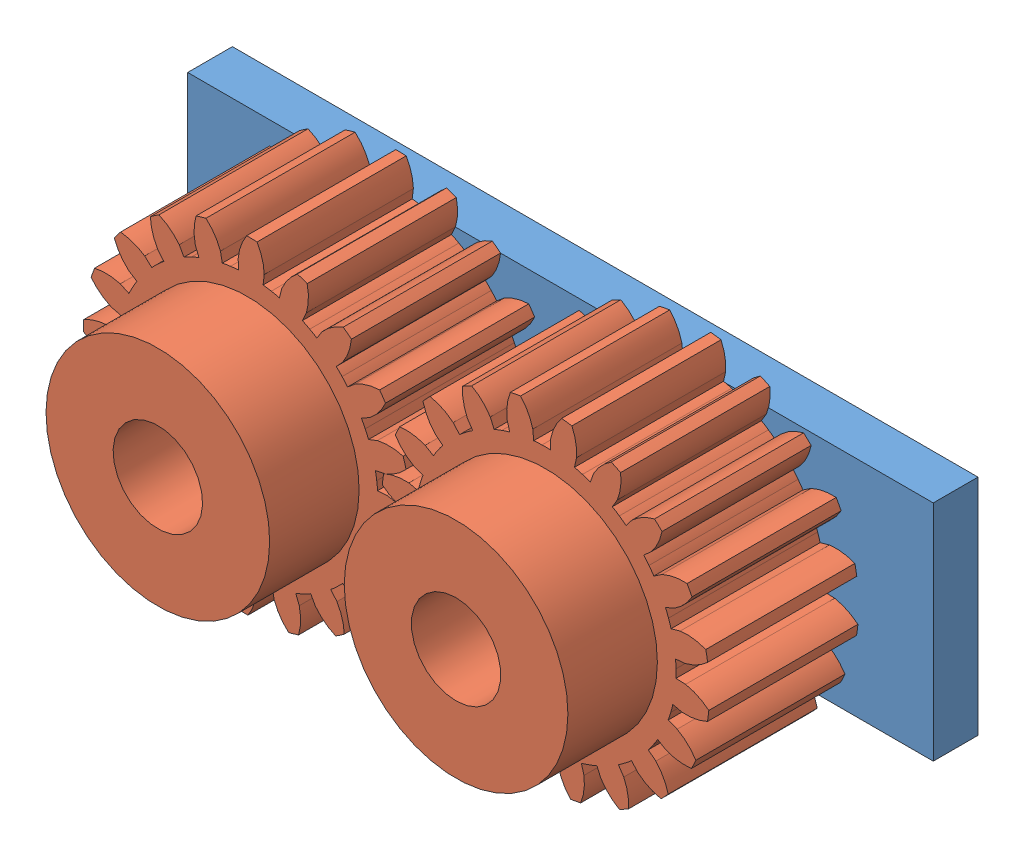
SolidWorks assembly Zahnrad.SLDASM, configuration Default (file format 3100). Lengths in mm.
Overall size (50.17 30.34 20).
3 component instances, 2 part files, 5 mates.
Components (placement in the parent):
- Teil2-1: Teil2.SLDPRT [Default] at (-6.5466 3.2721 1.2315) size (50 15 13)
- Zahnrad D22 M1-1: Zahnrad D22 M1.SLDPRT [Standard] at (8.4534 10.7721 5.2315) x (-0.429091 0.903261 0) z (-0.903261 -0.429091 0) size (21.83 16 21.83)
- Zahnrad D22 M1-2: Zahnrad D22 M1.SLDPRT [Standard] at (28.4534 10.7721 5.2315) x (-0.565376 -0.824833 0) z (0.824833 -0.565376 0) size (21.83 16 21.83)
Mates (geometry in assembly coordinates):
- Konzentrisch1: concentric anti-aligned: cylinder of Teil2-1; cylinder of Zahnrad D22 M1-1
- Konzentrisch2: concentric anti-aligned: cylinder of Teil2-1; cylinder of Zahnrad D22 M1-2
- Deckungsgleich1: coincident: plane of Zahnrad D22 M1-1 through (18.5815 7.2802 21.2315) normal (0 0 1); plane of Zahnrad D22 M1-2 through (26.3837 21.2835 21.2315) normal (0 0 1)
- Abstand1: distance = 1 mm: plane of Teil2-1 through (-6.5466 18.2721 4.2315) normal (0 0 1); plane of Zahnrad D22 M1-1 through (13.6282 25.3128 5.2315) normal (0 0 -1)
- Zahnradverknüpfung1: gear = 1000 mm: cylinder of Zahnrad D22 M1-1; cylinder of Zahnrad D22 M1-2
